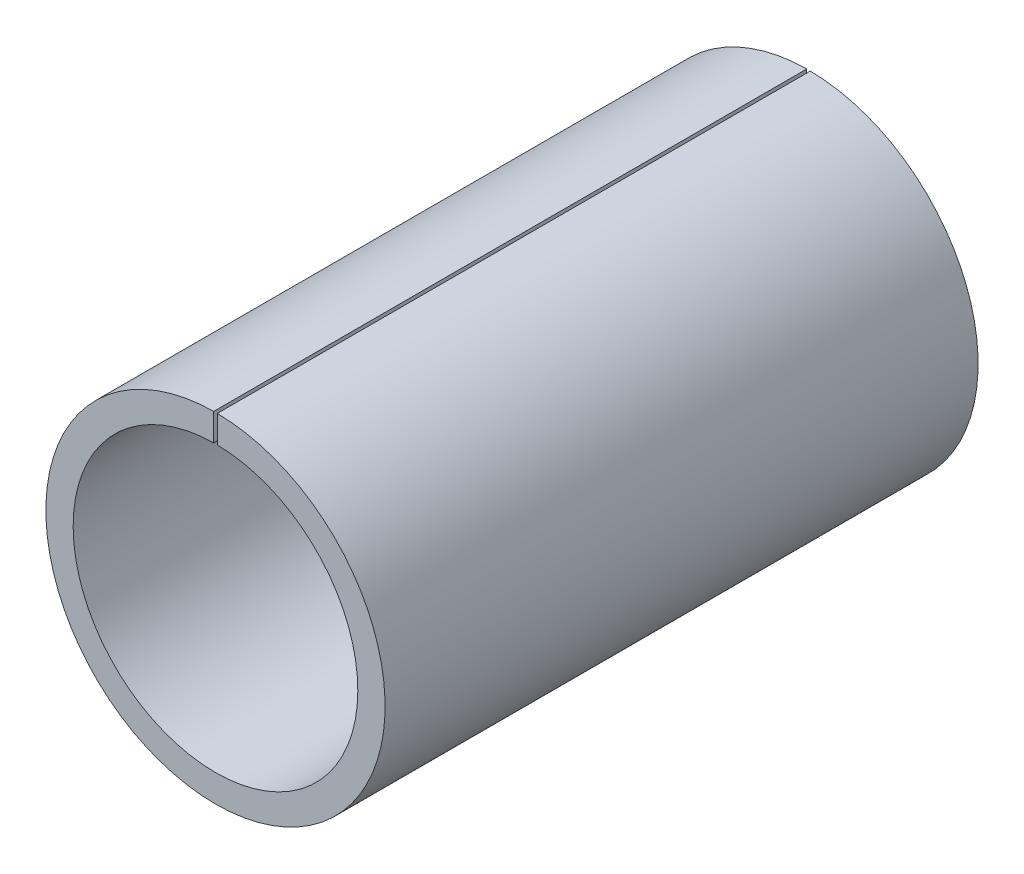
ISO-10303-21;
HEADER;
FILE_DESCRIPTION(('STEP AP214'),'2;1');
FILE_NAME('part.step','',(''),(''),'','','');
FILE_SCHEMA(('AUTOMOTIVE_DESIGN { 1 0 10303 214 1 1 1 1 }'));
ENDSEC;
DATA;
#1=APPLICATION_CONTEXT('core data for automotive mechanical design processes');
#2=APPLICATION_PROTOCOL_DEFINITION('international standard','automotive_design',2000,#1);
#3=PRODUCT_CONTEXT('',#1,'mechanical');
#4=PRODUCT('Part','Part','',(#3));
#5=PRODUCT_RELATED_PRODUCT_CATEGORY('part','',(#4));
#6=PRODUCT_DEFINITION_FORMATION('','',#4);
#7=PRODUCT_DEFINITION_CONTEXT('part definition',#1,'design');
#8=PRODUCT_DEFINITION('design','',#6,#7);
#9=PRODUCT_DEFINITION_SHAPE('','',#8);
#10=(LENGTH_UNIT() NAMED_UNIT(*) SI_UNIT(.MILLI.,.METRE.));
#11=(NAMED_UNIT(*) PLANE_ANGLE_UNIT() SI_UNIT($,.RADIAN.));
#12=(NAMED_UNIT(*) SI_UNIT($,.STERADIAN.) SOLID_ANGLE_UNIT());
#13=UNCERTAINTY_MEASURE_WITH_UNIT(LENGTH_MEASURE(1.E-05),#10,'distance_accuracy_value','');
#14=(GEOMETRIC_REPRESENTATION_CONTEXT(3) GLOBAL_UNCERTAINTY_ASSIGNED_CONTEXT((#13)) GLOBAL_UNIT_ASSIGNED_CONTEXT((#10,
#11,#12)) REPRESENTATION_CONTEXT('',''));
#15=CARTESIAN_POINT('',(0.,0.,0.));
#16=DIRECTION('',(0.,0.,1.));
#17=DIRECTION('',(1.,0.,0.));
#18=AXIS2_PLACEMENT_3D('',#15,#16,#17);
#19=CARTESIAN_POINT('',(190.,-9.9999999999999,45.7232539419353));
#20=DIRECTION('',(0.,0.,-1.));
#21=DIRECTION('',(-1.,0.,0.));
#22=AXIS2_PLACEMENT_3D('',#19,#20,#21);
#23=CYLINDRICAL_SURFACE('',#22,7.15);
#24=CARTESIAN_POINT('',(190.,-9.9999999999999,25.));
#25=DIRECTION('',(0.,0.,1.));
#26=DIRECTION('',(1.,0.,0.));
#27=AXIS2_PLACEMENT_3D('',#24,#25,#26);
#28=CIRCLE('',#27,7.15);
#29=CARTESIAN_POINT('',(189.925,-2.85039336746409,25.));
#30=VERTEX_POINT('',#29);
#31=CARTESIAN_POINT('',(190.075,-2.85039336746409,25.));
#32=VERTEX_POINT('',#31);
#33=EDGE_CURVE('E76',#30,#32,#28,.T.);
#34=ORIENTED_EDGE('',*,*,#33,.F.);
#35=DIRECTION('',(0.,0.,1.));
#36=VECTOR('',#35,1.);
#37=CARTESIAN_POINT('',(189.925,-2.85039336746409,0.));
#38=LINE('',#37,#36);
#39=CARTESIAN_POINT('',(189.925,-2.85039336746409,0.));
#40=VERTEX_POINT('',#39);
#41=EDGE_CURVE('E83',#40,#30,#38,.T.);
#42=ORIENTED_EDGE('',*,*,#41,.F.);
#43=CARTESIAN_POINT('',(190.,-9.9999999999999,0.));
#44=DIRECTION('',(0.,0.,1.));
#45=DIRECTION('',(1.,0.,0.));
#46=AXIS2_PLACEMENT_3D('',#43,#44,#45);
#47=CIRCLE('',#46,7.15);
#48=CARTESIAN_POINT('',(190.075,-2.85039336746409,0.));
#49=VERTEX_POINT('',#48);
#50=EDGE_CURVE('E11',#40,#49,#47,.T.);
#51=ORIENTED_EDGE('',*,*,#50,.T.);
#52=DIRECTION('',(0.,0.,1.));
#53=VECTOR('',#52,1.);
#54=CARTESIAN_POINT('',(190.075,-2.85039336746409,0.));
#55=LINE('',#54,#53);
#56=EDGE_CURVE('E85',#49,#32,#55,.T.);
#57=ORIENTED_EDGE('',*,*,#56,.T.);
#58=EDGE_LOOP('',(#34,#42,#51,#57));
#59=FACE_BOUND('',#58,.T.);
#60=ADVANCED_FACE('F35',(#59),#23,.T.);
#61=CARTESIAN_POINT('',(190.,-9.9999999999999,45.7232539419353));
#62=DIRECTION('',(0.,0.,-1.));
#63=DIRECTION('',(-1.,0.,0.));
#64=AXIS2_PLACEMENT_3D('',#61,#62,#63);
#65=CYLINDRICAL_SURFACE('',#64,6.00000000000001);
#66=DIRECTION('',(0.,0.,1.));
#67=VECTOR('',#66,1.);
#68=CARTESIAN_POINT('',(189.925,-4.00046876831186,0.));
#69=LINE('',#68,#67);
#70=CARTESIAN_POINT('',(189.925,-4.00046876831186,0.));
#71=VERTEX_POINT('',#70);
#72=CARTESIAN_POINT('',(189.925,-4.00046876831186,25.));
#73=VERTEX_POINT('',#72);
#74=EDGE_CURVE('E57',#71,#73,#69,.T.);
#75=ORIENTED_EDGE('',*,*,#74,.T.);
#76=CARTESIAN_POINT('',(190.,-9.9999999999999,25.));
#77=DIRECTION('',(0.,0.,-1.));
#78=DIRECTION('',(1.,0.,0.));
#79=AXIS2_PLACEMENT_3D('',#76,#77,#78);
#80=CIRCLE('',#79,6.00000000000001);
#81=CARTESIAN_POINT('',(190.075,-4.00046876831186,25.));
#82=VERTEX_POINT('',#81);
#83=EDGE_CURVE('E50',#82,#73,#80,.T.);
#84=ORIENTED_EDGE('',*,*,#83,.F.);
#85=DIRECTION('',(0.,0.,1.));
#86=VECTOR('',#85,1.);
#87=CARTESIAN_POINT('',(190.075,-4.00046876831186,0.));
#88=LINE('',#87,#86);
#89=CARTESIAN_POINT('',(190.075,-4.00046876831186,0.));
#90=VERTEX_POINT('',#89);
#91=EDGE_CURVE('E92',#90,#82,#88,.T.);
#92=ORIENTED_EDGE('',*,*,#91,.F.);
#93=CARTESIAN_POINT('',(190.,-9.9999999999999,0.));
#94=DIRECTION('',(0.,0.,1.));
#95=DIRECTION('',(1.,0.,0.));
#96=AXIS2_PLACEMENT_3D('',#93,#94,#95);
#97=CIRCLE('',#96,6.00000000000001);
#98=EDGE_CURVE('E39',#71,#90,#97,.T.);
#99=ORIENTED_EDGE('',*,*,#98,.F.);
#100=EDGE_LOOP('',(#75,#84,#92,#99));
#101=FACE_BOUND('',#100,.T.);
#102=ADVANCED_FACE('F37',(#101),#65,.F.);
#103=CARTESIAN_POINT('',(190.075,-2.85039336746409,0.));
#104=DIRECTION('',(1.,0.,0.));
#105=DIRECTION('',(0.,0.,-1.));
#106=AXIS2_PLACEMENT_3D('',#103,#104,#105);
#107=PLANE('',#106);
#108=DIRECTION('',(0.,-1.,0.));
#109=VECTOR('',#108,1.);
#110=CARTESIAN_POINT('',(190.075,-2.85039336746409,25.));
#111=LINE('',#110,#109);
#112=EDGE_CURVE('E86',#32,#82,#111,.T.);
#113=ORIENTED_EDGE('',*,*,#112,.F.);
#114=ORIENTED_EDGE('',*,*,#56,.F.);
#115=DIRECTION('',(0.,1.,0.));
#116=VECTOR('',#115,1.);
#117=CARTESIAN_POINT('',(190.075,-2.85039336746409,0.));
#118=LINE('',#117,#116);
#119=EDGE_CURVE('E99',#90,#49,#118,.T.);
#120=ORIENTED_EDGE('',*,*,#119,.F.);
#121=ORIENTED_EDGE('',*,*,#91,.T.);
#122=EDGE_LOOP('',(#113,#114,#120,#121));
#123=FACE_BOUND('',#122,.T.);
#124=ADVANCED_FACE('F109',(#123),#107,.F.);
#125=CARTESIAN_POINT('',(189.925,-2.85039336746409,0.));
#126=DIRECTION('',(-1.,0.,0.));
#127=DIRECTION('',(0.,0.,1.));
#128=AXIS2_PLACEMENT_3D('',#125,#126,#127);
#129=PLANE('',#128);
#130=DIRECTION('',(0.,1.,0.));
#131=VECTOR('',#130,1.);
#132=CARTESIAN_POINT('',(189.925,-4.00046876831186,25.));
#133=LINE('',#132,#131);
#134=EDGE_CURVE('E73',#73,#30,#133,.T.);
#135=ORIENTED_EDGE('',*,*,#134,.F.);
#136=ORIENTED_EDGE('',*,*,#74,.F.);
#137=DIRECTION('',(0.,-1.,0.));
#138=VECTOR('',#137,1.);
#139=CARTESIAN_POINT('',(189.925,-2.85039336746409,0.));
#140=LINE('',#139,#138);
#141=EDGE_CURVE('E89',#40,#71,#140,.T.);
#142=ORIENTED_EDGE('',*,*,#141,.F.);
#143=ORIENTED_EDGE('',*,*,#41,.T.);
#144=EDGE_LOOP('',(#135,#136,#142,#143));
#145=FACE_BOUND('',#144,.T.);
#146=ADVANCED_FACE('F88',(#145),#129,.F.);
#147=CARTESIAN_POINT('',(190.,-9.9999999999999,0.));
#148=DIRECTION('',(0.,0.,1.));
#149=DIRECTION('',(1.,0.,0.));
#150=AXIS2_PLACEMENT_3D('',#147,#148,#149);
#151=PLANE('',#150);
#152=ORIENTED_EDGE('',*,*,#50,.F.);
#153=ORIENTED_EDGE('',*,*,#141,.T.);
#154=ORIENTED_EDGE('',*,*,#98,.T.);
#155=ORIENTED_EDGE('',*,*,#119,.T.);
#156=EDGE_LOOP('',(#152,#153,#154,#155));
#157=FACE_BOUND('',#156,.T.);
#158=ADVANCED_FACE('F108',(#157),#151,.F.);
#159=CARTESIAN_POINT('',(190.,-9.9999999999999,25.));
#160=DIRECTION('',(0.,0.,1.));
#161=DIRECTION('',(1.,0.,0.));
#162=AXIS2_PLACEMENT_3D('',#159,#160,#161);
#163=PLANE('',#162);
#164=ORIENTED_EDGE('',*,*,#83,.T.);
#165=ORIENTED_EDGE('',*,*,#134,.T.);
#166=ORIENTED_EDGE('',*,*,#33,.T.);
#167=ORIENTED_EDGE('',*,*,#112,.T.);
#168=EDGE_LOOP('',(#164,#165,#166,#167));
#169=FACE_BOUND('',#168,.T.);
#170=ADVANCED_FACE('F75',(#169),#163,.T.);
#171=CLOSED_SHELL('',(#60,#102,#124,#146,#158,#170));
#172=MANIFOLD_SOLID_BREP('B2',#171);
#173=ADVANCED_BREP_SHAPE_REPRESENTATION('',(#18,#172),#14);
#174=SHAPE_DEFINITION_REPRESENTATION(#9,#173);
ENDSEC;
END-ISO-10303-21;
